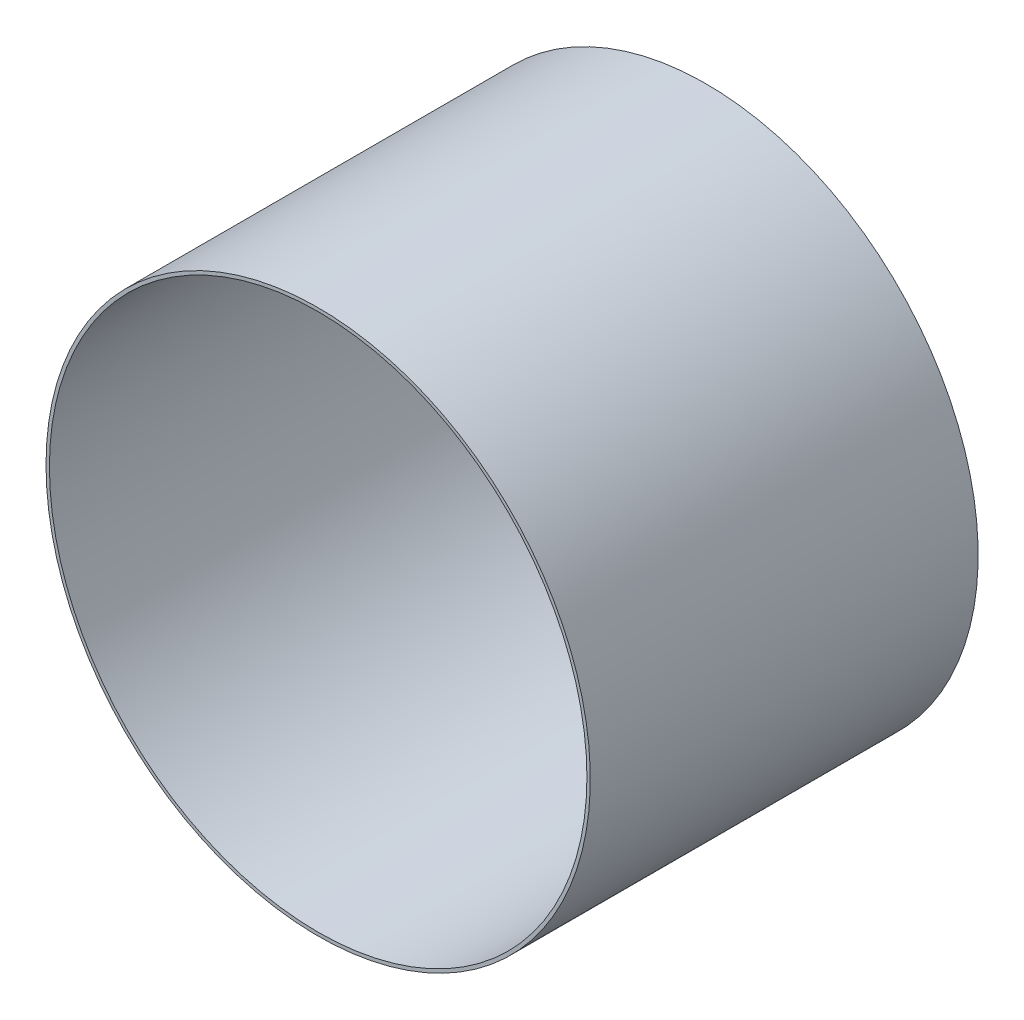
from build123d import *

# Parameters (mm, degrees)
SKETCH1_R           = 160
SKETCH1_R_2         = 158
BOSS_EXTRUDE1_DEPTH = 228


with BuildPart() as part:
    # Sketch1 → Boss-Extrude1 (new body)
    with BuildSketch(Plane.XY):
        with Locations(Location((0, 0, 0), (0, 0, 180))):
            Circle(SKETCH1_R)
        with Locations(Location((0, 0, 0), (0, 0, 180))):
            Circle(SKETCH1_R_2, mode=Mode.SUBTRACT)
    extrude(amount=BOSS_EXTRUDE1_DEPTH)


solid = part.part
